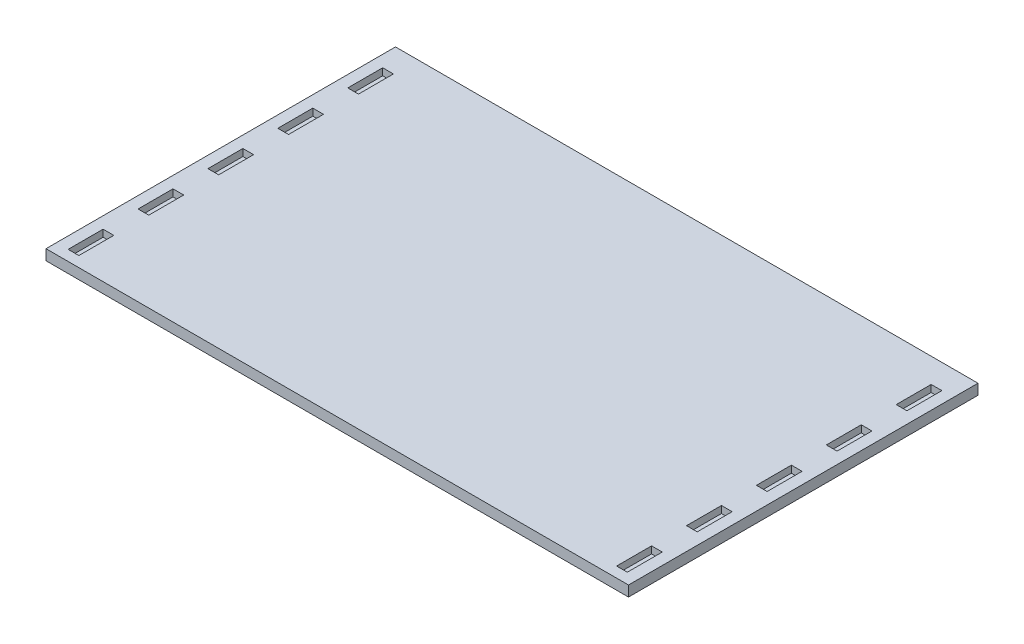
from build123d import *

# Parameters (mm, degrees)
SKETCH1_W           = 1000
SKETCH1_H           = 600
BOSS_EXTRUDE1_DEPTH = 18
SKETCH3_W           = 18.4
SKETCH3_H           = 60
CUT_EXTRUDE3_DEPTH  = 12
LPATTERN1_COUNT     = 5
LPATTERN1_PITCH     = 120
SKETCH4_W           = 18.4
SKETCH4_H           = 60
CUT_EXTRUDE4_DEPTH  = 12
LPATTERN2_COUNT     = 5
LPATTERN2_PITCH     = 120


with BuildPart() as part:
    # Sketch1 → Boss-Extrude1 (new body)
    with BuildSketch(Plane(origin=(0, 0, 0), x_dir=(1, 0, 0), z_dir=(0, 1, 0))):
        with Locations((-200.691990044, 9.249084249)):
            Rectangle(SKETCH1_W, SKETCH1_H)
    extrude(amount=BOSS_EXTRUDE1_DEPTH)

    # Sketch3 → Cut-Extrude3 (cut)
    with BuildSketch(Plane(origin=(0, 18, 0), x_dir=(1, 0, 0), z_dir=(0, 1, 0))):
        with Locations((-671.491990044, 237.249084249)):
            Rectangle(SKETCH3_W, SKETCH3_H)
    cut_extrude3 = extrude(amount=-CUT_EXTRUDE3_DEPTH, mode=Mode.SUBTRACT)

    # LPattern1: Cut-Extrude3 ×5
    with Locations(*[(0, 0, i * LPATTERN1_PITCH) for i in range(1, LPATTERN1_COUNT)]):
        add(cut_extrude3, mode=Mode.SUBTRACT)

    # Sketch4 → Cut-Extrude4 (cut)
    with BuildSketch(Plane(origin=(0, 18, 0), x_dir=(1, 0, 0), z_dir=(0, 1, 0))):
        with Locations((270.108009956, 237.249084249)):
            Rectangle(SKETCH4_W, SKETCH4_H)
    cut_extrude4 = extrude(amount=-CUT_EXTRUDE4_DEPTH, mode=Mode.SUBTRACT)

    # LPattern2: Cut-Extrude4 ×5
    with Locations(*[(0, 0, i * LPATTERN2_PITCH) for i in range(1, LPATTERN2_COUNT)]):
        add(cut_extrude4, mode=Mode.SUBTRACT)


solid = part.part
